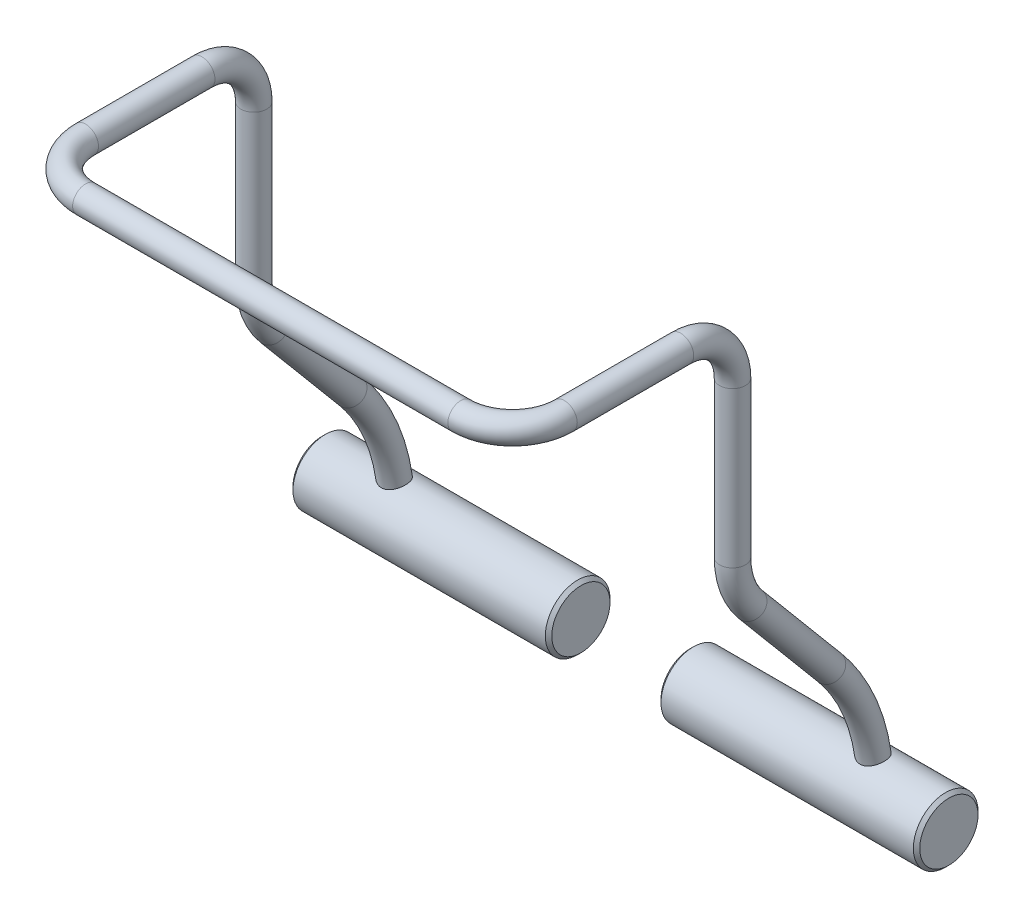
ISO-10303-21;
HEADER;
FILE_DESCRIPTION(('STEP AP214'),'2;1');
FILE_NAME('part.step','',(''),(''),'','','');
FILE_SCHEMA(('AUTOMOTIVE_DESIGN { 1 0 10303 214 1 1 1 1 }'));
ENDSEC;
DATA;
#1=APPLICATION_CONTEXT('core data for automotive mechanical design processes');
#2=APPLICATION_PROTOCOL_DEFINITION('international standard','automotive_design',2000,#1);
#3=PRODUCT_CONTEXT('',#1,'mechanical');
#4=PRODUCT('Part','Part','',(#3));
#5=PRODUCT_RELATED_PRODUCT_CATEGORY('part','',(#4));
#6=PRODUCT_DEFINITION_FORMATION('','',#4);
#7=PRODUCT_DEFINITION_CONTEXT('part definition',#1,'design');
#8=PRODUCT_DEFINITION('design','',#6,#7);
#9=PRODUCT_DEFINITION_SHAPE('','',#8);
#10=(LENGTH_UNIT() NAMED_UNIT(*) SI_UNIT(.MILLI.,.METRE.));
#11=(NAMED_UNIT(*) PLANE_ANGLE_UNIT() SI_UNIT($,.RADIAN.));
#12=(NAMED_UNIT(*) SI_UNIT($,.STERADIAN.) SOLID_ANGLE_UNIT());
#13=UNCERTAINTY_MEASURE_WITH_UNIT(LENGTH_MEASURE(1.E-05),#10,'distance_accuracy_value','');
#14=(GEOMETRIC_REPRESENTATION_CONTEXT(3) GLOBAL_UNCERTAINTY_ASSIGNED_CONTEXT((#13)) GLOBAL_UNIT_ASSIGNED_CONTEXT((#10,
#11,#12)) REPRESENTATION_CONTEXT('',''));
#15=CARTESIAN_POINT('',(0.,0.,0.));
#16=DIRECTION('',(0.,0.,1.));
#17=DIRECTION('',(1.,0.,0.));
#18=AXIS2_PLACEMENT_3D('',#15,#16,#17);
#19=CARTESIAN_POINT('',(0.,0.247335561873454,15.));
#20=DIRECTION('',(1.,0.,0.));
#21=DIRECTION('',(0.,0.,-1.));
#22=AXIS2_PLACEMENT_3D('',#19,#20,#21);
#23=TOROIDAL_SURFACE('',#22,15.,1.);
#24=CARTESIAN_POINT('',(0.,9.88914970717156,3.50933335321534));
#25=DIRECTION('',(0.,0.766044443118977,0.64278760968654));
#26=DIRECTION('',(0.,-0.64278760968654,0.766044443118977));
#27=AXIS2_PLACEMENT_3D('',#24,#25,#26);
#28=CIRCLE('',#27,1.);
#29=CARTESIAN_POINT('',(0.,9.24636209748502,4.27537779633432));
#30=VERTEX_POINT('',#29);
#31=EDGE_CURVE('E156',#30,#30,#28,.T.);
#32=ORIENTED_EDGE('',*,*,#31,.F.);
#33=EDGE_LOOP('',(#32));
#34=FACE_BOUND('',#33,.T.);
#35=CARTESIAN_POINT('',(-0.55641556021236,2.40483675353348,-0.683198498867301));
#36=CARTESIAN_POINT('',(-0.604496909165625,2.4144449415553,-0.64937574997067));
#37=CARTESIAN_POINT('',(-0.649573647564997,2.42446022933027,-0.611402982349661));
#38=CARTESIAN_POINT('',(-0.73275649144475,2.44390562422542,-0.528339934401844));
#39=CARTESIAN_POINT('',(-0.770861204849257,2.45333561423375,-0.483248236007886));
#40=CARTESIAN_POINT('',(-0.839230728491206,2.47033494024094,-0.387078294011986));
#41=CARTESIAN_POINT('',(-0.869488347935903,2.47790256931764,-0.335994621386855));
#42=CARTESIAN_POINT('',(-0.921172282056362,2.49004929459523,-0.229208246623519));
#43=CARTESIAN_POINT('',(-0.942602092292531,2.4946295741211,-0.173507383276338));
#44=CARTESIAN_POINT('',(-0.975259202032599,2.49988006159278,-0.0607496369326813));
#45=CARTESIAN_POINT('',(-0.986764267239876,2.50065977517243,-0.0037788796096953));
#46=CARTESIAN_POINT('',(-0.999964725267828,2.49818619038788,0.111198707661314));
#47=CARTESIAN_POINT('',(-1.00166524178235,2.49493499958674,0.169204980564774));
#48=CARTESIAN_POINT('',(-0.995272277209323,2.48485244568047,0.279944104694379));
#49=CARTESIAN_POINT('',(-0.987903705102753,2.47830785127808,0.332746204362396));
#50=CARTESIAN_POINT('',(-0.964754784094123,2.46224251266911,0.435994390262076));
#51=CARTESIAN_POINT('',(-0.948975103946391,2.45272200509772,0.486440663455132));
#52=CARTESIAN_POINT('',(-0.909836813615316,2.43161163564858,0.58280459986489));
#53=CARTESIAN_POINT('',(-0.886608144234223,2.42005868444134,0.628783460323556));
#54=CARTESIAN_POINT('',(-0.833185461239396,2.39566949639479,0.716118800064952));
#55=CARTESIAN_POINT('',(-0.802989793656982,2.38283295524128,0.75747417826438));
#56=CARTESIAN_POINT('',(-0.734769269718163,2.35623134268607,0.836663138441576));
#57=CARTESIAN_POINT('',(-0.696431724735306,2.34245170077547,0.874222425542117));
#58=CARTESIAN_POINT('',(-0.61389814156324,2.31577030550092,0.94263412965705));
#59=CARTESIAN_POINT('',(-0.569700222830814,2.30286883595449,0.973484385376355));
#60=CARTESIAN_POINT('',(-0.474595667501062,2.27864985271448,1.0289361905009));
#61=CARTESIAN_POINT('',(-0.423490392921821,2.26741717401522,1.05323565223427));
#62=CARTESIAN_POINT('',(-0.31741701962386,2.24840796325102,1.09323198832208));
#63=CARTESIAN_POINT('',(-0.262450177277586,2.24063031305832,1.10893164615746));
#64=CARTESIAN_POINT('',(-0.151926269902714,2.22962121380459,1.13090122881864));
#65=CARTESIAN_POINT('',(-0.0964350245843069,2.22626181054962,1.13743693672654));
#66=CARTESIAN_POINT('',(0.0149668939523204,2.22407389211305,1.14171030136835));
#67=CARTESIAN_POINT('',(0.0708774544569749,2.2252442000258,1.13945024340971));
#68=CARTESIAN_POINT('',(0.179001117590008,2.23182236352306,1.12650607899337));
#69=CARTESIAN_POINT('',(0.231269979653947,2.23704642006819,1.11618723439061));
#70=CARTESIAN_POINT('',(0.33320752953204,2.2509436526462,1.08788742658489));
#71=CARTESIAN_POINT('',(0.382875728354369,2.25961747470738,1.0699050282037));
#72=CARTESIAN_POINT('',(0.479593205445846,2.27980343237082,1.0262004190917));
#73=CARTESIAN_POINT('',(0.526546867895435,2.29138067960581,1.00029716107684));
#74=CARTESIAN_POINT('',(0.615377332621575,2.31616205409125,0.941493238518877));
#75=CARTESIAN_POINT('',(0.657252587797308,2.32936667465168,0.908590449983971));
#76=CARTESIAN_POINT('',(0.736786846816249,2.35687934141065,0.834711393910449));
#77=CARTESIAN_POINT('',(0.774152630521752,2.37121003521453,0.793426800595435));
#78=CARTESIAN_POINT('',(0.841177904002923,2.39905418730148,0.7047651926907));
#79=CARTESIAN_POINT('',(0.870838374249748,2.4125677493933,0.657388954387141));
#80=CARTESIAN_POINT('',(0.921085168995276,2.43734139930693,0.558498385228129));
#81=CARTESIAN_POINT('',(0.941809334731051,2.44863413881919,0.507062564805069));
#82=CARTESIAN_POINT('',(0.974127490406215,2.46824093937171,0.400868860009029));
#83=CARTESIAN_POINT('',(0.985725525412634,2.47655631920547,0.346112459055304));
#84=CARTESIAN_POINT('',(0.999039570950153,2.48919114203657,0.238149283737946));
#85=CARTESIAN_POINT('',(1.00127584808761,2.49370943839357,0.185029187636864));
#86=CARTESIAN_POINT('',(0.997341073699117,2.49931842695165,0.0789267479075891));
#87=CARTESIAN_POINT('',(0.991170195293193,2.50040918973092,0.0259444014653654));
#88=CARTESIAN_POINT('',(0.970861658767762,2.49931981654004,-0.0780018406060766));
#89=CARTESIAN_POINT('',(0.956784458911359,2.49716429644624,-0.128977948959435));
#90=CARTESIAN_POINT('',(0.921267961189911,2.49007002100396,-0.228084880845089));
#91=CARTESIAN_POINT('',(0.899826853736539,2.48513058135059,-0.276215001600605));
#92=CARTESIAN_POINT('',(0.848676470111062,2.47274528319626,-0.371454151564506));
#93=CARTESIAN_POINT('',(0.818535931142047,2.46516265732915,-0.418313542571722));
#94=CARTESIAN_POINT('',(0.751426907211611,2.448548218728,-0.506589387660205));
#95=CARTESIAN_POINT('',(0.714454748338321,2.43951562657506,-0.548002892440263));
#96=CARTESIAN_POINT('',(0.631824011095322,2.42048940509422,-0.626883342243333));
#97=CARTESIAN_POINT('',(0.585756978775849,2.41047147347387,-0.663918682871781));
#98=CARTESIAN_POINT('',(0.48771151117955,2.39144922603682,-0.729479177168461));
#99=CARTESIAN_POINT('',(0.435734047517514,2.38244474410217,-0.758005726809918));
#100=CARTESIAN_POINT('',(0.328723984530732,2.36710023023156,-0.804627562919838));
#101=CARTESIAN_POINT('',(0.273824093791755,2.36069036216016,-0.823001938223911));
#102=CARTESIAN_POINT('',(0.161348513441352,2.3512730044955,-0.849541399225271));
#103=CARTESIAN_POINT('',(0.10377580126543,2.34826181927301,-0.857717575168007));
#104=CARTESIAN_POINT('',(-0.00580939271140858,2.34630084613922,-0.863061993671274));
#105=CARTESIAN_POINT('',(-0.0577647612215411,2.34695458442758,-0.861304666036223));
#106=CARTESIAN_POINT('',(-0.160561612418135,2.35131045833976,-0.849340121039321));
#107=CARTESIAN_POINT('',(-0.211402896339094,2.35501313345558,-0.839131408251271));
#108=CARTESIAN_POINT('',(-0.313963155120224,2.36526822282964,-0.809790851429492));
#109=CARTESIAN_POINT('',(-0.365501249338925,2.37199940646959,-0.790092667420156));
#110=CARTESIAN_POINT('',(-0.464366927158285,2.38731424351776,-0.742530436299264));
#111=CARTESIAN_POINT('',(-0.51169109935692,2.39589937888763,-0.714659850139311));
#112=CARTESIAN_POINT('',(-0.55641556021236,2.40483675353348,-0.683198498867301));
#113=B_SPLINE_CURVE_WITH_KNOTS('',3,(#35,#36,#37,#38,#39,#40,#41,#42,#43,#44,#45,#46,#47,#48,
#49,#50,#51,#52,#53,#54,#55,#56,#57,#58,#59,#60,#61,#62,#63,#64,#65,#66,#67,#68,#69,#70,#71,#72,
#73,#74,#75,#76,#77,#78,#79,#80,#81,#82,#83,#84,#85,#86,#87,#88,#89,#90,#91,#92,#93,#94,#95,#96,
#97,#98,#99,#100,#101,#102,#103,#104,#105,#106,#107,#108,#109,#110,#111,#112),.UNSPECIFIED.,.T.,
.F.,(4,2,2,2,2,2,2,2,2,2,2,2,2,2,2,2,2,2,2,2,2,2,2,2,2,2,2,2,2,2,2,2,2,2,2,2,2,2,4),(0.,
0.178492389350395,0.357020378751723,0.535711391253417,0.714331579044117,0.887773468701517,
1.06112471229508,1.22147598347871,1.38181450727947,1.53949571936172,1.69721440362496,
1.86271186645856,2.02826256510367,2.2004880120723,2.37265768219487,2.53972265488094,
2.70674422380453,2.86660617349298,3.02649807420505,3.1903590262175,3.35426977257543,
3.5259355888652,3.69757955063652,3.86647196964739,4.03528948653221,4.19458937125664,
4.35388597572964,4.51198073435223,4.67011437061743,4.83808208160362,5.00614038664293,
5.18512438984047,5.36407901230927,5.53783226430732,5.71139639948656,5.86657290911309,
6.02177688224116,6.1876743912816,6.35370500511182),.UNSPECIFIED.);
#114=CARTESIAN_POINT('',(-0.55641556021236,2.40483675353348,-0.683198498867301));
#115=VERTEX_POINT('',#114);
#116=EDGE_CURVE('E72',#115,#115,#113,.T.);
#117=ORIENTED_EDGE('',*,*,#116,.T.);
#118=EDGE_LOOP('',(#117));
#119=FACE_BOUND('',#118,.T.);
#120=ADVANCED_FACE('F31',(#34,#119),#23,.T.);
#121=CARTESIAN_POINT('',(-3.99999999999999,37.,28.));
#122=DIRECTION('',(-1.,0.,0.));
#123=DIRECTION('',(0.,0.,1.));
#124=AXIS2_PLACEMENT_3D('',#121,#122,#123);
#125=CYLINDRICAL_SURFACE('',#124,1.);
#126=CARTESIAN_POINT('',(-3.99999999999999,37.,28.));
#127=DIRECTION('',(-1.,0.,0.));
#128=DIRECTION('',(0.,-1.,0.));
#129=AXIS2_PLACEMENT_3D('',#126,#127,#128);
#130=CIRCLE('',#129,1.);
#131=CARTESIAN_POINT('',(-3.99999999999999,37.,29.));
#132=VERTEX_POINT('',#131);
#133=EDGE_CURVE('E63',#132,#132,#130,.T.);
#134=ORIENTED_EDGE('',*,*,#133,.T.);
#135=EDGE_LOOP('',(#134));
#136=FACE_BOUND('',#135,.T.);
#137=CARTESIAN_POINT('',(-33.,37.,27.9999999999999));
#138=DIRECTION('',(-1.,0.,0.));
#139=DIRECTION('',(0.,-1.,0.));
#140=AXIS2_PLACEMENT_3D('',#137,#138,#139);
#141=CIRCLE('',#140,1.);
#142=CARTESIAN_POINT('',(-33.,37.,28.9999999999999));
#143=VERTEX_POINT('',#142);
#144=EDGE_CURVE('E157',#143,#143,#141,.T.);
#145=ORIENTED_EDGE('',*,*,#144,.F.);
#146=EDGE_LOOP('',(#145));
#147=FACE_BOUND('',#146,.T.);
#148=ADVANCED_FACE('F100',(#136,#147),#125,.T.);
#149=CARTESIAN_POINT('',(-4.,37.,24.));
#150=DIRECTION('',(0.,-1.,0.));
#151=DIRECTION('',(0.,0.,-1.));
#152=AXIS2_PLACEMENT_3D('',#149,#150,#151);
#153=TOROIDAL_SURFACE('',#152,4.,1.);
#154=CARTESIAN_POINT('',(0.,37.,24.));
#155=DIRECTION('',(0.,0.,1.));
#156=DIRECTION('',(0.,-1.,0.));
#157=AXIS2_PLACEMENT_3D('',#154,#155,#156);
#158=CIRCLE('',#157,1.);
#159=CARTESIAN_POINT('',(1.,37.,24.));
#160=VERTEX_POINT('',#159);
#161=EDGE_CURVE('E182',#160,#160,#158,.T.);
#162=CARTESIAN_POINT('',(-4.,37.,24.));
#163=DIRECTION('',(0.,-1.,0.));
#164=DIRECTION('',(0.,0.,-1.));
#165=AXIS2_PLACEMENT_3D('',#162,#163,#164);
#166=CIRCLE('',#165,5.);
#167=EDGE_CURVE('',#160,#132,#166,.T.);
#168=ORIENTED_EDGE('',*,*,#161,.T.);
#169=ORIENTED_EDGE('',*,*,#133,.F.);
#170=ORIENTED_EDGE('',*,*,#167,.T.);
#171=ORIENTED_EDGE('',*,*,#167,.F.);
#172=EDGE_LOOP('',(#168,#170,#169,#171));
#173=FACE_BOUND('',#172,.T.);
#174=ADVANCED_FACE('F105',(#173),#153,.T.);
#175=CARTESIAN_POINT('',(0.,37.,15.));
#176=DIRECTION('',(0.,0.,1.));
#177=DIRECTION('',(1.,0.,0.));
#178=AXIS2_PLACEMENT_3D('',#175,#176,#177);
#179=CYLINDRICAL_SURFACE('',#178,1.);
#180=CARTESIAN_POINT('',(0.,37.,15.));
#181=DIRECTION('',(0.,0.,1.));
#182=DIRECTION('',(0.,-1.,0.));
#183=AXIS2_PLACEMENT_3D('',#180,#181,#182);
#184=CIRCLE('',#183,1.);
#185=CARTESIAN_POINT('',(0.,38.,15.));
#186=VERTEX_POINT('',#185);
#187=EDGE_CURVE('E179',#186,#186,#184,.T.);
#188=ORIENTED_EDGE('',*,*,#187,.T.);
#189=EDGE_LOOP('',(#188));
#190=FACE_BOUND('',#189,.T.);
#191=ORIENTED_EDGE('',*,*,#161,.F.);
#192=EDGE_LOOP('',(#191));
#193=FACE_BOUND('',#192,.T.);
#194=ADVANCED_FACE('F130',(#190,#193),#179,.T.);
#195=CARTESIAN_POINT('',(0.,33.,15.));
#196=DIRECTION('',(1.,0.,0.));
#197=DIRECTION('',(0.,0.,-1.));
#198=AXIS2_PLACEMENT_3D('',#195,#196,#197);
#199=TOROIDAL_SURFACE('',#198,4.,1.);
#200=CARTESIAN_POINT('',(0.,33.,11.));
#201=DIRECTION('',(0.,1.,0.));
#202=DIRECTION('',(0.,0.,1.));
#203=AXIS2_PLACEMENT_3D('',#200,#201,#202);
#204=CIRCLE('',#203,1.);
#205=CARTESIAN_POINT('',(0.,33.,10.));
#206=VERTEX_POINT('',#205);
#207=EDGE_CURVE('E176',#206,#206,#204,.T.);
#208=CARTESIAN_POINT('',(0.,33.,15.));
#209=DIRECTION('',(1.,0.,0.));
#210=DIRECTION('',(0.,0.,-1.));
#211=AXIS2_PLACEMENT_3D('',#208,#209,#210);
#212=CIRCLE('',#211,5.);
#213=EDGE_CURVE('',#206,#186,#212,.T.);
#214=ORIENTED_EDGE('',*,*,#207,.T.);
#215=ORIENTED_EDGE('',*,*,#187,.F.);
#216=ORIENTED_EDGE('',*,*,#213,.T.);
#217=ORIENTED_EDGE('',*,*,#213,.F.);
#218=EDGE_LOOP('',(#214,#216,#215,#217));
#219=FACE_BOUND('',#218,.T.);
#220=ADVANCED_FACE('F126',(#219),#199,.T.);
#221=CARTESIAN_POINT('',(0.,21.,11.));
#222=DIRECTION('',(0.,1.,0.));
#223=DIRECTION('',(0.,0.,1.));
#224=AXIS2_PLACEMENT_3D('',#221,#222,#223);
#225=CYLINDRICAL_SURFACE('',#224,1.);
#226=CARTESIAN_POINT('',(0.,21.,11.));
#227=DIRECTION('',(0.,1.,0.));
#228=DIRECTION('',(0.,0.,1.));
#229=AXIS2_PLACEMENT_3D('',#226,#227,#228);
#230=CIRCLE('',#229,1.);
#231=CARTESIAN_POINT('',(0.,21.,12.));
#232=VERTEX_POINT('',#231);
#233=EDGE_CURVE('E173',#232,#232,#230,.T.);
#234=ORIENTED_EDGE('',*,*,#233,.T.);
#235=EDGE_LOOP('',(#234));
#236=FACE_BOUND('',#235,.T.);
#237=ORIENTED_EDGE('',*,*,#207,.F.);
#238=EDGE_LOOP('',(#237));
#239=FACE_BOUND('',#238,.T.);
#240=ADVANCED_FACE('F122',(#236,#239),#225,.T.);
#241=CARTESIAN_POINT('',(0.,21.,5.));
#242=DIRECTION('',(-1.,0.,0.));
#243=DIRECTION('',(0.,0.,1.));
#244=AXIS2_PLACEMENT_3D('',#241,#242,#243);
#245=TOROIDAL_SURFACE('',#244,6.,1.);
#246=CARTESIAN_POINT('',(0.,17.1432743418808,9.59626665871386));
#247=DIRECTION('',(0.,0.766044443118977,0.64278760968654));
#248=DIRECTION('',(0.,-0.64278760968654,0.766044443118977));
#249=AXIS2_PLACEMENT_3D('',#246,#247,#248);
#250=CIRCLE('',#249,1.);
#251=CARTESIAN_POINT('',(0.,16.5004867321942,10.3623111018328));
#252=VERTEX_POINT('',#251);
#253=EDGE_CURVE('E159',#252,#252,#250,.T.);
#254=CARTESIAN_POINT('',(0.,21.,5.));
#255=DIRECTION('',(-1.,0.,0.));
#256=DIRECTION('',(0.,0.,1.));
#257=AXIS2_PLACEMENT_3D('',#254,#255,#256);
#258=CIRCLE('',#257,7.);
#259=EDGE_CURVE('',#252,#232,#258,.T.);
#260=ORIENTED_EDGE('',*,*,#253,.T.);
#261=ORIENTED_EDGE('',*,*,#233,.F.);
#262=ORIENTED_EDGE('',*,*,#259,.T.);
#263=ORIENTED_EDGE('',*,*,#259,.F.);
#264=EDGE_LOOP('',(#260,#262,#261,#263));
#265=FACE_BOUND('',#264,.T.);
#266=ADVANCED_FACE('F118',(#265),#245,.T.);
#267=CARTESIAN_POINT('',(0.,9.88914970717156,3.50933335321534));
#268=DIRECTION('',(0.,0.766044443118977,0.64278760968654));
#269=DIRECTION('',(0.,-0.64278760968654,0.766044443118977));
#270=AXIS2_PLACEMENT_3D('',#267,#268,#269);
#271=CYLINDRICAL_SURFACE('',#270,1.);
#272=ORIENTED_EDGE('',*,*,#31,.T.);
#273=EDGE_LOOP('',(#272));
#274=FACE_BOUND('',#273,.T.);
#275=ORIENTED_EDGE('',*,*,#253,.F.);
#276=EDGE_LOOP('',(#275));
#277=FACE_BOUND('',#276,.T.);
#278=ADVANCED_FACE('F115',(#274,#277),#271,.T.);
#279=CARTESIAN_POINT('',(5.72,0.,0.));
#280=DIRECTION('',(-1.,0.,0.));
#281=DIRECTION('',(0.,0.,1.));
#282=AXIS2_PLACEMENT_3D('',#279,#280,#281);
#283=CYLINDRICAL_SURFACE('',#282,2.5);
#284=CARTESIAN_POINT('',(-14.03,0.,0.));
#285=DIRECTION('',(1.,0.,0.));
#286=DIRECTION('',(0.,0.,-1.));
#287=AXIS2_PLACEMENT_3D('',#284,#285,#286);
#288=CIRCLE('',#287,2.5);
#289=CARTESIAN_POINT('',(-14.03,0.,-2.5));
#290=VERTEX_POINT('',#289);
#291=EDGE_CURVE('E46',#290,#290,#288,.T.);
#292=ORIENTED_EDGE('',*,*,#291,.T.);
#293=EDGE_LOOP('',(#292));
#294=FACE_BOUND('',#293,.T.);
#295=CARTESIAN_POINT('',(5.47,0.,0.));
#296=DIRECTION('',(1.,0.,0.));
#297=DIRECTION('',(0.,0.,-1.));
#298=AXIS2_PLACEMENT_3D('',#295,#296,#297);
#299=CIRCLE('',#298,2.5);
#300=CARTESIAN_POINT('',(5.47,0.,-2.5));
#301=VERTEX_POINT('',#300);
#302=EDGE_CURVE('E51',#301,#301,#299,.F.);
#303=ORIENTED_EDGE('',*,*,#302,.T.);
#304=EDGE_LOOP('',(#303));
#305=FACE_BOUND('',#304,.T.);
#306=ORIENTED_EDGE('',*,*,#116,.F.);
#307=EDGE_LOOP('',(#306));
#308=FACE_BOUND('',#307,.T.);
#309=ADVANCED_FACE('F112',(#294,#305,#308),#283,.T.);
#310=CARTESIAN_POINT('',(5.72,0.,0.));
#311=DIRECTION('',(1.,0.,0.));
#312=DIRECTION('',(0.,0.,-1.));
#313=AXIS2_PLACEMENT_3D('',#310,#311,#312);
#314=PLANE('',#313);
#315=CARTESIAN_POINT('',(5.72,0.,0.));
#316=DIRECTION('',(1.,0.,0.));
#317=DIRECTION('',(0.,0.,-1.));
#318=AXIS2_PLACEMENT_3D('',#315,#316,#317);
#319=CIRCLE('',#318,2.25);
#320=CARTESIAN_POINT('',(5.72,0.,-2.25));
#321=VERTEX_POINT('',#320);
#322=EDGE_CURVE('E38',#321,#321,#319,.T.);
#323=ORIENTED_EDGE('',*,*,#322,.T.);
#324=EDGE_LOOP('',(#323));
#325=FACE_BOUND('',#324,.T.);
#326=ADVANCED_FACE('F152',(#325),#314,.T.);
#327=CARTESIAN_POINT('',(-14.28,0.,0.));
#328=DIRECTION('',(1.,0.,0.));
#329=DIRECTION('',(0.,0.,-1.));
#330=AXIS2_PLACEMENT_3D('',#327,#328,#329);
#331=PLANE('',#330);
#332=CARTESIAN_POINT('',(-14.28,0.,0.));
#333=DIRECTION('',(1.,0.,0.));
#334=DIRECTION('',(0.,0.,-1.));
#335=AXIS2_PLACEMENT_3D('',#332,#333,#334);
#336=CIRCLE('',#335,2.25);
#337=CARTESIAN_POINT('',(-14.28,0.,-2.25));
#338=VERTEX_POINT('',#337);
#339=EDGE_CURVE('E42',#338,#338,#336,.F.);
#340=ORIENTED_EDGE('',*,*,#339,.T.);
#341=EDGE_LOOP('',(#340));
#342=FACE_BOUND('',#341,.T.);
#343=ADVANCED_FACE('F244',(#342),#331,.F.);
#344=CARTESIAN_POINT('',(-33.,37.,24.));
#345=DIRECTION('',(0.,1.,0.));
#346=DIRECTION('',(-1.,0.,0.));
#347=AXIS2_PLACEMENT_3D('',#344,#345,#346);
#348=TOROIDAL_SURFACE('',#347,3.99999999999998,1.);
#349=CARTESIAN_POINT('',(-37.,37.,23.9999999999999));
#350=DIRECTION('',(0.,0.,-1.));
#351=DIRECTION('',(0.,-1.,0.));
#352=AXIS2_PLACEMENT_3D('',#349,#350,#351);
#353=CIRCLE('',#352,1.);
#354=CARTESIAN_POINT('',(-38.,37.,23.9999999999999));
#355=VERTEX_POINT('',#354);
#356=EDGE_CURVE('E162',#355,#355,#353,.T.);
#357=CARTESIAN_POINT('',(-33.,37.,24.));
#358=DIRECTION('',(0.,1.,0.));
#359=DIRECTION('',(-1.,0.,0.));
#360=AXIS2_PLACEMENT_3D('',#357,#358,#359);
#361=CIRCLE('',#360,4.99999999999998);
#362=EDGE_CURVE('',#355,#143,#361,.T.);
#363=ORIENTED_EDGE('',*,*,#356,.F.);
#364=ORIENTED_EDGE('',*,*,#144,.T.);
#365=ORIENTED_EDGE('',*,*,#362,.T.);
#366=ORIENTED_EDGE('',*,*,#362,.F.);
#367=EDGE_LOOP('',(#363,#365,#364,#366));
#368=FACE_BOUND('',#367,.T.);
#369=ADVANCED_FACE('F239',(#368),#348,.T.);
#370=CARTESIAN_POINT('',(-36.9999999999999,37.,14.9999999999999));
#371=DIRECTION('',(0.,0.,1.));
#372=DIRECTION('',(1.,0.,0.));
#373=AXIS2_PLACEMENT_3D('',#370,#371,#372);
#374=CYLINDRICAL_SURFACE('',#373,1.);
#375=CARTESIAN_POINT('',(-36.9999999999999,37.,14.9999999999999));
#376=DIRECTION('',(0.,0.,-1.));
#377=DIRECTION('',(0.,-1.,0.));
#378=AXIS2_PLACEMENT_3D('',#375,#376,#377);
#379=CIRCLE('',#378,1.);
#380=CARTESIAN_POINT('',(-36.9999999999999,38.,14.9999999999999));
#381=VERTEX_POINT('',#380);
#382=EDGE_CURVE('E167',#381,#381,#379,.T.);
#383=ORIENTED_EDGE('',*,*,#382,.F.);
#384=EDGE_LOOP('',(#383));
#385=FACE_BOUND('',#384,.T.);
#386=ORIENTED_EDGE('',*,*,#356,.T.);
#387=EDGE_LOOP('',(#386));
#388=FACE_BOUND('',#387,.T.);
#389=ADVANCED_FACE('F233',(#385,#388),#374,.T.);
#390=CARTESIAN_POINT('',(-36.9999999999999,33.,14.9999999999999));
#391=DIRECTION('',(1.,0.,0.));
#392=DIRECTION('',(0.,0.,-1.));
#393=AXIS2_PLACEMENT_3D('',#390,#391,#392);
#394=TOROIDAL_SURFACE('',#393,4.,1.);
#395=CARTESIAN_POINT('',(-36.9999999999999,33.,10.9999999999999));
#396=DIRECTION('',(0.,-1.,0.));
#397=DIRECTION('',(0.,0.,1.));
#398=AXIS2_PLACEMENT_3D('',#395,#396,#397);
#399=CIRCLE('',#398,1.);
#400=CARTESIAN_POINT('',(-36.9999999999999,33.,9.99999999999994));
#401=VERTEX_POINT('',#400);
#402=EDGE_CURVE('E200',#401,#401,#399,.T.);
#403=CARTESIAN_POINT('',(-36.9999999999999,33.,14.9999999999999));
#404=DIRECTION('',(1.,0.,0.));
#405=DIRECTION('',(0.,0.,-1.));
#406=AXIS2_PLACEMENT_3D('',#403,#404,#405);
#407=CIRCLE('',#406,5.);
#408=EDGE_CURVE('',#401,#381,#407,.T.);
#409=ORIENTED_EDGE('',*,*,#402,.F.);
#410=ORIENTED_EDGE('',*,*,#382,.T.);
#411=ORIENTED_EDGE('',*,*,#408,.T.);
#412=ORIENTED_EDGE('',*,*,#408,.F.);
#413=EDGE_LOOP('',(#409,#411,#410,#412));
#414=FACE_BOUND('',#413,.T.);
#415=ADVANCED_FACE('F227',(#414),#394,.T.);
#416=CARTESIAN_POINT('',(-36.9999999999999,21.,10.9999999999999));
#417=DIRECTION('',(0.,1.,0.));
#418=DIRECTION('',(-1.,0.,0.));
#419=AXIS2_PLACEMENT_3D('',#416,#417,#418);
#420=CYLINDRICAL_SURFACE('',#419,1.);
#421=CARTESIAN_POINT('',(-36.9999999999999,21.,10.9999999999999));
#422=DIRECTION('',(0.,-1.,0.));
#423=DIRECTION('',(0.,0.,1.));
#424=AXIS2_PLACEMENT_3D('',#421,#422,#423);
#425=CIRCLE('',#424,1.);
#426=CARTESIAN_POINT('',(-36.9999999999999,21.,11.9999999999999));
#427=VERTEX_POINT('',#426);
#428=EDGE_CURVE('E203',#427,#427,#425,.T.);
#429=ORIENTED_EDGE('',*,*,#428,.F.);
#430=EDGE_LOOP('',(#429));
#431=FACE_BOUND('',#430,.T.);
#432=ORIENTED_EDGE('',*,*,#402,.T.);
#433=EDGE_LOOP('',(#432));
#434=FACE_BOUND('',#433,.T.);
#435=ADVANCED_FACE('F221',(#431,#434),#420,.T.);
#436=CARTESIAN_POINT('',(-36.9999999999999,21.,4.99999999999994));
#437=DIRECTION('',(-1.,0.,0.));
#438=DIRECTION('',(0.,0.,1.));
#439=AXIS2_PLACEMENT_3D('',#436,#437,#438);
#440=TOROIDAL_SURFACE('',#439,6.,1.);
#441=CARTESIAN_POINT('',(-36.9999999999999,17.1432743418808,9.5962666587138));
#442=DIRECTION('',(0.,-0.766044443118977,-0.64278760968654));
#443=DIRECTION('',(0.,-0.64278760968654,0.766044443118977));
#444=AXIS2_PLACEMENT_3D('',#441,#442,#443);
#445=CIRCLE('',#444,1.);
#446=CARTESIAN_POINT('',(-36.9999999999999,16.5004867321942,10.3623111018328));
#447=VERTEX_POINT('',#446);
#448=EDGE_CURVE('E206',#447,#447,#445,.T.);
#449=CARTESIAN_POINT('',(-36.9999999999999,21.,4.99999999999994));
#450=DIRECTION('',(-1.,0.,0.));
#451=DIRECTION('',(0.,0.,1.));
#452=AXIS2_PLACEMENT_3D('',#449,#450,#451);
#453=CIRCLE('',#452,7.);
#454=EDGE_CURVE('',#447,#427,#453,.T.);
#455=ORIENTED_EDGE('',*,*,#448,.F.);
#456=ORIENTED_EDGE('',*,*,#428,.T.);
#457=ORIENTED_EDGE('',*,*,#454,.T.);
#458=ORIENTED_EDGE('',*,*,#454,.F.);
#459=EDGE_LOOP('',(#455,#457,#456,#458));
#460=FACE_BOUND('',#459,.T.);
#461=ADVANCED_FACE('F216',(#460),#440,.T.);
#462=CARTESIAN_POINT('',(-36.9999999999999,9.88914970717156,3.50933335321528));
#463=DIRECTION('',(0.,0.766044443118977,0.64278760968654));
#464=DIRECTION('',(0.,-0.64278760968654,0.766044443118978));
#465=AXIS2_PLACEMENT_3D('',#462,#463,#464);
#466=CYLINDRICAL_SURFACE('',#465,1.);
#467=CARTESIAN_POINT('',(-36.9999999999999,9.88914970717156,3.50933335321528));
#468=DIRECTION('',(0.,-0.766044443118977,-0.64278760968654));
#469=DIRECTION('',(0.,-0.64278760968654,0.766044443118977));
#470=AXIS2_PLACEMENT_3D('',#467,#468,#469);
#471=CIRCLE('',#470,1.);
#472=CARTESIAN_POINT('',(-36.9999999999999,9.24636209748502,4.27537779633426));
#473=VERTEX_POINT('',#472);
#474=EDGE_CURVE('E71',#473,#473,#471,.T.);
#475=ORIENTED_EDGE('',*,*,#474,.F.);
#476=EDGE_LOOP('',(#475));
#477=FACE_BOUND('',#476,.T.);
#478=ORIENTED_EDGE('',*,*,#448,.T.);
#479=EDGE_LOOP('',(#478));
#480=FACE_BOUND('',#479,.T.);
#481=ADVANCED_FACE('F213',(#477,#480),#466,.T.);
#482=CARTESIAN_POINT('',(-36.9999999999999,0.247335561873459,14.9999999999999));
#483=DIRECTION('',(1.,0.,0.));
#484=DIRECTION('',(0.,0.,-1.));
#485=AXIS2_PLACEMENT_3D('',#482,#483,#484);
#486=TOROIDAL_SURFACE('',#485,15.,1.);
#487=CARTESIAN_POINT('',(-37.6930650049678,2.4346276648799,-0.567969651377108));
#488=CARTESIAN_POINT('',(-37.7337780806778,2.44416092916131,-0.527100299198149));
#489=CARTESIAN_POINT('',(-37.7711816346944,2.45341582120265,-0.482750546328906));
#490=CARTESIAN_POINT('',(-37.8384491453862,2.47014006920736,-0.388224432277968));
#491=CARTESIAN_POINT('',(-37.8682934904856,2.47760477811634,-0.338033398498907));
#492=CARTESIAN_POINT('',(-37.9195159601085,2.48967603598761,-0.233036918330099));
#493=CARTESIAN_POINT('',(-37.940878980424,2.49427749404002,-0.178223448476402));
#494=CARTESIAN_POINT('',(-37.9741598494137,2.4997710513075,-0.0656600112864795));
#495=CARTESIAN_POINT('',(-37.9860880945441,2.50066723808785,-0.00791335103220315));
#496=CARTESIAN_POINT('',(-37.9994980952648,2.49837996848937,0.105569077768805));
#497=CARTESIAN_POINT('',(-38.001505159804,2.49541245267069,0.16124688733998));
#498=CARTESIAN_POINT('',(-37.9962548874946,2.48579552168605,0.271843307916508));
#499=CARTESIAN_POINT('',(-37.9889992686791,2.47914678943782,0.326762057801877));
#500=CARTESIAN_POINT('',(-37.9660564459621,2.46307700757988,0.431150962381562));
#501=CARTESIAN_POINT('',(-37.9508519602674,2.45382742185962,0.480754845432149));
#502=CARTESIAN_POINT('',(-37.9128001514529,2.4331287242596,0.576439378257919));
#503=CARTESIAN_POINT('',(-37.8899522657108,2.42167945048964,0.622519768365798));
#504=CARTESIAN_POINT('',(-37.8367349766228,2.39720648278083,0.711024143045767));
#505=CARTESIAN_POINT('',(-37.8062185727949,2.38415492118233,0.753351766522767));
#506=CARTESIAN_POINT('',(-37.7387394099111,2.3577214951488,0.832399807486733));
#507=CARTESIAN_POINT('',(-37.7017744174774,2.34433951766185,0.869118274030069));
#508=CARTESIAN_POINT('',(-37.6200263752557,2.3176080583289,0.938158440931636));
#509=CARTESIAN_POINT('',(-37.5749199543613,2.30430298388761,0.970115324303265));
#510=CARTESIAN_POINT('',(-37.4795999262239,2.2798282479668,1.02631670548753));
#511=CARTESIAN_POINT('',(-37.429385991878,2.2686587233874,1.05056070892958));
#512=CARTESIAN_POINT('',(-37.3246929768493,2.2495484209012,1.09088840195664));
#513=CARTESIAN_POINT('',(-37.270181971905,2.24163519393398,1.10690273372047));
#514=CARTESIAN_POINT('',(-37.1588622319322,2.23010976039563,1.12994707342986));
#515=CARTESIAN_POINT('',(-37.1020545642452,2.22649557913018,1.13698120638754));
#516=CARTESIAN_POINT('',(-36.9907858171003,2.22407829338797,1.14170094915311));
#517=CARTESIAN_POINT('',(-36.9363482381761,2.22504526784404,1.13983329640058));
#518=CARTESIAN_POINT('',(-36.8286353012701,2.23115252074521,1.12783097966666));
#519=CARTESIAN_POINT('',(-36.7753599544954,2.23629283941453,1.11769623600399));
#520=CARTESIAN_POINT('',(-36.6721835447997,2.25007567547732,1.08967724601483));
#521=CARTESIAN_POINT('',(-36.6222460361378,2.25866883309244,1.0719019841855));
#522=CARTESIAN_POINT('',(-36.5261532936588,2.27849513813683,1.02908423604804));
#523=CARTESIAN_POINT('',(-36.4799990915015,2.28972900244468,1.00403977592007));
#524=CARTESIAN_POINT('',(-36.3903993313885,2.3143946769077,0.945844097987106));
#525=CARTESIAN_POINT('',(-36.3471914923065,2.32790631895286,0.912360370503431));
#526=CARTESIAN_POINT('',(-36.2671238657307,2.35545553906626,0.838674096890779));
#527=CARTESIAN_POINT('',(-36.2302652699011,2.36949321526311,0.798470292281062));
#528=CARTESIAN_POINT('',(-36.1631304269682,2.39715911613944,0.711174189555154));
#529=CARTESIAN_POINT('',(-36.1330240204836,2.41077063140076,0.663945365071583));
#530=CARTESIAN_POINT('',(-36.0814902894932,2.43597775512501,0.564480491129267));
#531=CARTESIAN_POINT('',(-36.0600594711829,2.44757417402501,0.512246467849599));
#532=CARTESIAN_POINT('',(-36.027409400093,2.46724361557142,0.406759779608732));
#533=CARTESIAN_POINT('',(-36.0157665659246,2.47545393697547,0.353663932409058));
#534=CARTESIAN_POINT('',(-36.0014408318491,2.48847092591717,0.245877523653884));
#535=CARTESIAN_POINT('',(-35.9987556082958,2.4932784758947,0.191187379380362));
#536=CARTESIAN_POINT('',(-36.0022342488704,2.49913160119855,0.0842152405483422));
#537=CARTESIAN_POINT('',(-36.0080308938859,2.50032681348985,0.0319286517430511));
#538=CARTESIAN_POINT('',(-36.0274703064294,2.49951949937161,-0.0711313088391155));
#539=CARTESIAN_POINT('',(-36.0411140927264,2.49751655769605,-0.12190448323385));
#540=CARTESIAN_POINT('',(-36.0762198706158,2.49063205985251,-0.222153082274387));
#541=CARTESIAN_POINT('',(-36.0979016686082,2.48566691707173,-0.271545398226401));
#542=CARTESIAN_POINT('',(-36.1483259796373,2.47348382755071,-0.366282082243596));
#543=CARTESIAN_POINT('',(-36.1770711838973,2.46626502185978,-0.411624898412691));
#544=CARTESIAN_POINT('',(-36.2433559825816,2.44982669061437,-0.500544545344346));
#545=CARTESIAN_POINT('',(-36.2813962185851,2.44049715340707,-0.543728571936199));
#546=CARTESIAN_POINT('',(-36.3640331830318,2.42141891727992,-0.623221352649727));
#547=CARTESIAN_POINT('',(-36.4086328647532,2.41167003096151,-0.659526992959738));
#548=CARTESIAN_POINT('',(-36.5048928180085,2.39278685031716,-0.72510118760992));
#549=CARTESIAN_POINT('',(-36.5567226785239,2.3836792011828,-0.754130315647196));
#550=CARTESIAN_POINT('',(-36.6650773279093,2.367857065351,-0.802437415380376));
#551=CARTESIAN_POINT('',(-36.7215979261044,2.36114047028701,-0.821723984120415));
#552=CARTESIAN_POINT('',(-36.8328577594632,2.35169994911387,-0.848346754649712));
#553=CARTESIAN_POINT('',(-36.887371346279,2.34869703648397,-0.856523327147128));
#554=CARTESIAN_POINT('',(-36.9970515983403,2.3462348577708,-0.863248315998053));
#555=CARTESIAN_POINT('',(-37.0522178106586,2.34677326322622,-0.86180305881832));
#556=CARTESIAN_POINT('',(-37.1565586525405,2.35109388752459,-0.849934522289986));
#557=CARTESIAN_POINT('',(-37.2058381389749,2.35459088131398,-0.840300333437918));
#558=CARTESIAN_POINT('',(-37.3021083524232,2.36396665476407,-0.813548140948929));
#559=CARTESIAN_POINT('',(-37.3490973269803,2.36984722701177,-0.796424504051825));
#560=CARTESIAN_POINT('',(-37.4413994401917,2.38349813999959,-0.754610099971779));
#561=CARTESIAN_POINT('',(-37.4865860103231,2.39133041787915,-0.729662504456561));
#562=CARTESIAN_POINT('',(-37.5724532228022,2.40780600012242,-0.673294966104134));
#563=CARTESIAN_POINT('',(-37.6131418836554,2.4164478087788,-0.641886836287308));
#564=CARTESIAN_POINT('',(-37.6655511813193,2.42824029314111,-0.594833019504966));
#565=CARTESIAN_POINT('',(-37.6794920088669,2.43144944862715,-0.581594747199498));
#566=CARTESIAN_POINT('',(-37.6930650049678,2.4346276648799,-0.567969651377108));
#567=B_SPLINE_CURVE_WITH_KNOTS('',3,(#487,#488,#489,#490,#491,#492,#493,#494,#495,#496,#497,
#498,#499,#500,#501,#502,#503,#504,#505,#506,#507,#508,#509,#510,#511,#512,#513,#514,#515,#516,
#517,#518,#519,#520,#521,#522,#523,#524,#525,#526,#527,#528,#529,#530,#531,#532,#533,#534,#535,
#536,#537,#538,#539,#540,#541,#542,#543,#544,#545,#546,#547,#548,#549,#550,#551,#552,#553,#554,
#555,#556,#557,#558,#559,#560,#561,#562,#563,#564,#565,#566),.UNSPECIFIED.,.T.,.F.,(4,2,2,2,2,2,
2,2,2,2,2,2,2,2,2,2,2,2,2,2,2,2,2,2,2,2,2,2,2,2,2,2,2,2,2,2,2,2,2,4),(0.,0.175358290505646,
0.351166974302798,0.52728736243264,0.703213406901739,0.86971659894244,1.03618891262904,
1.19355878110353,1.35094023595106,1.51160571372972,1.67232694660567,1.84211359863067,
2.01191113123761,2.18311713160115,2.3542444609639,2.51687683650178,2.67951077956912,
2.83989811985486,3.0003290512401,3.16849129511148,3.33668506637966,3.50872591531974,
3.68069741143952,3.84477497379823,4.00880997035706,4.16594990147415,4.32311023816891,
4.48493018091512,4.6468118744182,4.82093454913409,4.99513586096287,5.17448061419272,
5.3536668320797,5.51836068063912,5.68294625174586,5.83326524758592,5.9836975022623,
6.13970259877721,6.29542493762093,6.35388618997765),.UNSPECIFIED.);
#568=CARTESIAN_POINT('',(-37.6930650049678,2.4346276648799,-0.567969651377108));
#569=VERTEX_POINT('',#568);
#570=EDGE_CURVE('E64',#569,#569,#567,.T.);
#571=ORIENTED_EDGE('',*,*,#570,.T.);
#572=EDGE_LOOP('',(#571));
#573=FACE_BOUND('',#572,.T.);
#574=ORIENTED_EDGE('',*,*,#474,.T.);
#575=EDGE_LOOP('',(#574));
#576=FACE_BOUND('',#575,.T.);
#577=ADVANCED_FACE('F78',(#573,#576),#486,.T.);
#578=CARTESIAN_POINT('',(-42.7199999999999,0.,0.));
#579=DIRECTION('',(1.,0.,0.));
#580=DIRECTION('',(0.,0.,-1.));
#581=AXIS2_PLACEMENT_3D('',#578,#579,#580);
#582=CYLINDRICAL_SURFACE('',#581,2.5);
#583=CARTESIAN_POINT('',(-22.9699999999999,0.,0.));
#584=DIRECTION('',(-1.,0.,0.));
#585=DIRECTION('',(0.,0.,1.));
#586=AXIS2_PLACEMENT_3D('',#583,#584,#585);
#587=CIRCLE('',#586,2.5);
#588=CARTESIAN_POINT('',(-22.9699999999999,0.,2.49999999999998));
#589=VERTEX_POINT('',#588);
#590=EDGE_CURVE('E54',#589,#589,#587,.T.);
#591=ORIENTED_EDGE('',*,*,#590,.T.);
#592=EDGE_LOOP('',(#591));
#593=FACE_BOUND('',#592,.T.);
#594=CARTESIAN_POINT('',(-42.4699999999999,0.,0.));
#595=DIRECTION('',(-1.,0.,0.));
#596=DIRECTION('',(0.,0.,1.));
#597=AXIS2_PLACEMENT_3D('',#594,#595,#596);
#598=CIRCLE('',#597,2.5);
#599=CARTESIAN_POINT('',(-42.4699999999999,0.,2.49999999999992));
#600=VERTEX_POINT('',#599);
#601=EDGE_CURVE('E57',#600,#600,#598,.F.);
#602=ORIENTED_EDGE('',*,*,#601,.T.);
#603=EDGE_LOOP('',(#602));
#604=FACE_BOUND('',#603,.T.);
#605=ORIENTED_EDGE('',*,*,#570,.F.);
#606=EDGE_LOOP('',(#605));
#607=FACE_BOUND('',#606,.T.);
#608=ADVANCED_FACE('F81',(#593,#604,#607),#582,.T.);
#609=CARTESIAN_POINT('',(-42.7199999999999,0.,0.));
#610=DIRECTION('',(-1.,0.,0.));
#611=DIRECTION('',(0.,0.,-1.));
#612=AXIS2_PLACEMENT_3D('',#609,#610,#611);
#613=PLANE('',#612);
#614=CARTESIAN_POINT('',(-42.7199999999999,0.,0.));
#615=DIRECTION('',(-1.,0.,0.));
#616=DIRECTION('',(0.,0.,1.));
#617=AXIS2_PLACEMENT_3D('',#614,#615,#616);
#618=CIRCLE('',#617,2.25);
#619=CARTESIAN_POINT('',(-42.7199999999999,0.,2.24999999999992));
#620=VERTEX_POINT('',#619);
#621=EDGE_CURVE('E10',#620,#620,#618,.T.);
#622=ORIENTED_EDGE('',*,*,#621,.T.);
#623=EDGE_LOOP('',(#622));
#624=FACE_BOUND('',#623,.T.);
#625=ADVANCED_FACE('F85',(#624),#613,.T.);
#626=CARTESIAN_POINT('',(-22.7199999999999,0.,0.));
#627=DIRECTION('',(-1.,0.,0.));
#628=DIRECTION('',(0.,0.,-1.));
#629=AXIS2_PLACEMENT_3D('',#626,#627,#628);
#630=PLANE('',#629);
#631=CARTESIAN_POINT('',(-22.7199999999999,0.,0.));
#632=DIRECTION('',(-1.,0.,0.));
#633=DIRECTION('',(0.,0.,1.));
#634=AXIS2_PLACEMENT_3D('',#631,#632,#633);
#635=CIRCLE('',#634,2.25);
#636=CARTESIAN_POINT('',(-22.7199999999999,0.,2.24999999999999));
#637=VERTEX_POINT('',#636);
#638=EDGE_CURVE('E60',#637,#637,#635,.F.);
#639=ORIENTED_EDGE('',*,*,#638,.T.);
#640=EDGE_LOOP('',(#639));
#641=FACE_BOUND('',#640,.T.);
#642=ADVANCED_FACE('F89',(#641),#630,.F.);
#643=CARTESIAN_POINT('',(-22.7199999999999,0.,0.));
#644=DIRECTION('',(-1.,0.,0.));
#645=DIRECTION('',(0.,0.,1.));
#646=AXIS2_PLACEMENT_3D('',#643,#644,#645);
#647=CONICAL_SURFACE('',#646,2.25,0.785398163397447);
#648=ORIENTED_EDGE('',*,*,#590,.F.);
#649=EDGE_LOOP('',(#648));
#650=FACE_BOUND('',#649,.T.);
#651=ORIENTED_EDGE('',*,*,#638,.F.);
#652=EDGE_LOOP('',(#651));
#653=FACE_BOUND('',#652,.T.);
#654=ADVANCED_FACE('F91',(#650,#653),#647,.T.);
#655=CARTESIAN_POINT('',(-14.03,0.,0.));
#656=DIRECTION('',(1.,0.,0.));
#657=DIRECTION('',(0.,0.,-1.));
#658=AXIS2_PLACEMENT_3D('',#655,#656,#657);
#659=CONICAL_SURFACE('',#658,2.5,0.785398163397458);
#660=ORIENTED_EDGE('',*,*,#339,.F.);
#661=EDGE_LOOP('',(#660));
#662=FACE_BOUND('',#661,.T.);
#663=ORIENTED_EDGE('',*,*,#291,.F.);
#664=EDGE_LOOP('',(#663));
#665=FACE_BOUND('',#664,.T.);
#666=ADVANCED_FACE('F96',(#662,#665),#659,.T.);
#667=CARTESIAN_POINT('',(5.72,0.,0.));
#668=DIRECTION('',(-1.,0.,0.));
#669=DIRECTION('',(0.,0.,1.));
#670=AXIS2_PLACEMENT_3D('',#667,#668,#669);
#671=CONICAL_SURFACE('',#670,2.25,0.785398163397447);
#672=ORIENTED_EDGE('',*,*,#302,.F.);
#673=EDGE_LOOP('',(#672));
#674=FACE_BOUND('',#673,.T.);
#675=ORIENTED_EDGE('',*,*,#322,.F.);
#676=EDGE_LOOP('',(#675));
#677=FACE_BOUND('',#676,.T.);
#678=ADVANCED_FACE('F139',(#674,#677),#671,.T.);
#679=CARTESIAN_POINT('',(-42.4699999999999,0.,0.));
#680=DIRECTION('',(1.,0.,0.));
#681=DIRECTION('',(0.,0.,-1.));
#682=AXIS2_PLACEMENT_3D('',#679,#680,#681);
#683=CONICAL_SURFACE('',#682,2.5,0.785398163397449);
#684=ORIENTED_EDGE('',*,*,#621,.F.);
#685=EDGE_LOOP('',(#684));
#686=FACE_BOUND('',#685,.T.);
#687=ORIENTED_EDGE('',*,*,#601,.F.);
#688=EDGE_LOOP('',(#687));
#689=FACE_BOUND('',#688,.T.);
#690=ADVANCED_FACE('F33',(#686,#689),#683,.T.);
#691=CLOSED_SHELL('',(#120,#148,#174,#194,#220,#240,#266,#278,#309,#326,#343,#369,#389,#415,
#435,#461,#481,#577,#608,#625,#642,#654,#666,#678,#690));
#692=MANIFOLD_SOLID_BREP('B2',#691);
#693=ADVANCED_BREP_SHAPE_REPRESENTATION('',(#18,#692),#14);
#694=SHAPE_DEFINITION_REPRESENTATION(#9,#693);
ENDSEC;
END-ISO-10303-21;
